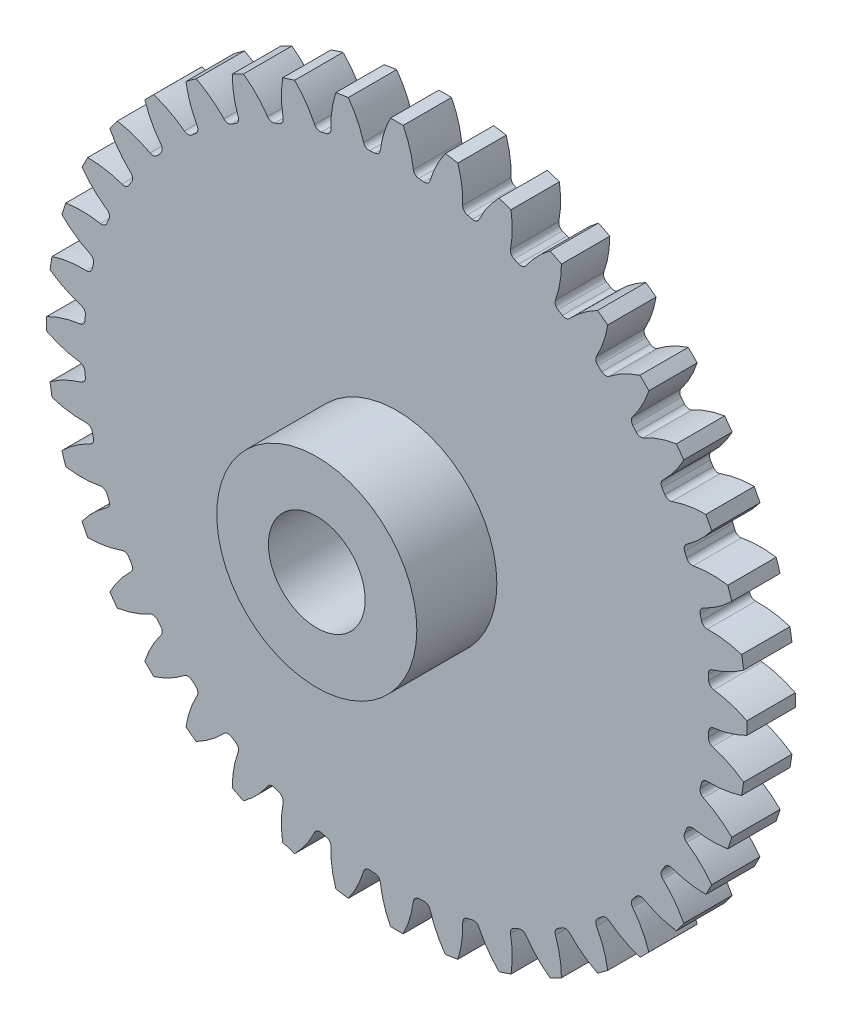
from build123d import *
from build123d.topology import SkipClean

# Parameters (mm, degrees)
BOSS_EXTRU_1_DEPTH                 = 1.45
CONG_1_R                           = 0.175
R_P_TITION_CIRCULAIRE4_COUNT       = 40
CONG_1_OF_R_P_TITION_CIRCULAIRE4_R = 0.175
ESQUISSE10_R                       = 1.45
ENL_V_MAT_EXTRU_4_DEPTH            = 17.295323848
ESQUISSE12_R                       = 3
ESQUISSE12_R_2                     = 1.45
EXTRUSION2_DEPTH                   = 2.4
EXTRUSION1_START                   = 0.5
ESQUISSE11_R                       = 2.2
ESQUISSE11_R_2                     = 1.45
EXTRUSION1_DEPTH                   = 0.5


with BuildPart() as part:
    # Esquisse3 → Boss.-Extru.1 (new body)
    with BuildSketch(Plane.XY):
        with BuildLine():
            Line((-2.114260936, 8.785747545), (-1.378706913, -0.560352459))
            Line((-1.378706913, -0.560352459), (-0.643152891, 8.785747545))
            ThreePointArc((-0.643152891, 8.785747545), (-0.755559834, 8.793914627), (-0.868056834, 8.800729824))
            ThreePointArc((-0.868056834, 8.800729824), (-0.972489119, 9.385057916), (-1.188551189, 9.937925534))
            ThreePointArc((-1.188551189, 9.937925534), (-1.378706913, 9.939647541), (-1.568862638, 9.937925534))
            ThreePointArc((-1.568862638, 9.937925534), (-1.784924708, 9.385057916), (-1.889356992, 8.800729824))
            ThreePointArc((-1.889356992, 8.800729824), (-2.001853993, 8.793914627), (-2.114260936, 8.785747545))
        make_face()
    boss_extru_1 = extrude(amount=BOSS_EXTRU_1_DEPTH)

    # Cong_1
    cong_1_edges = [part.edges().sort_by_distance(p)[0] for p in [
        (-1.889356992, 8.800729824, 0.725),
        (-0.868056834, 8.800729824, 0.725),
    ]]
    fillet(cong_1_edges, radius=CONG_1_R)

    # R_p_tition circulaire4: Boss.-Extru.1 ×40 about axis
    r_p_tition_circulaire4_axis = Axis((-1.378706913, -0.560352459, 0), (0, 0, 1))
    for i in range(1, R_P_TITION_CIRCULAIRE4_COUNT):
        add(boss_extru_1.rotate(r_p_tition_circulaire4_axis, i * 360 / R_P_TITION_CIRCULAIRE4_COUNT))

    # Cong_1 of R_p_tition circulaire4
    cong_1_of_r_p_tition_circulaire4_edges = [part.edges().sort_by_distance(p)[0] for p in [
        (-3.347465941, 8.605596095, 0.725),
        (-2.338739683, 8.765362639, 0.725),
        (-4.757097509, 8.184766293, 0.725),
        (-3.785783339, 8.500365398, 0.725),
        (-6.083541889, 7.548602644, 0.725),
        (-5.173556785, 8.012263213, 0.725),
        (-7.294137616, 6.712769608, 0.725),
        (-6.467888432, 7.313074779, 0.725),
        (-8.359075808, 5.697848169, 0.725),
        (-7.636907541, 6.420016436, 0.725),
        (-9.252134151, 4.52882906, 0.725),
        (-8.65182898, 5.355078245, 0.725),
        (-9.951322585, 3.234497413, 0.725),
        (-9.487662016, 4.144482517, 0.725),
        (-10.43942477, 1.846723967, 0.725),
        (-10.123825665, 2.818038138, 0.725),
        (-10.704422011, 0.399680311, 0.725),
        (-10.544655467, 1.40840657, 0.725),
        (-10.739789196, -1.071002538, 0.725),
        (-10.739789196, -0.04970238, 0.725),
        (-10.544655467, -2.529111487, 0.725),
        (-10.704422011, -1.520385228, 0.725),
        (-10.123825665, -3.938743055, 0.725),
        (-10.43942477, -2.967428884, 0.725),
        (-9.487662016, -5.265187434, 0.725),
        (-9.951322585, -4.35520233, 0.725),
        (-8.65182898, -6.475783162, 0.725),
        (-9.252134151, -5.649533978, 0.725),
        (-7.636907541, -7.540721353, 0.725),
        (-8.359075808, -6.818553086, 0.725),
        (-6.467888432, -8.433779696, 0.725),
        (-7.294137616, -7.833474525, 0.725),
        (-5.173556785, -9.13296813, 0.725),
        (-6.083541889, -8.669307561, 0.725),
        (-3.785783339, -9.621070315, 0.725),
        (-4.757097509, -9.30547121, 0.725),
        (-2.338739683, -9.886067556, 0.725),
        (-3.347465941, -9.726301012, 0.725),
        (-0.868056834, -9.921434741, 0.725),
        (-1.889356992, -9.921434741, 0.725),
        (0.590052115, -9.726301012, 0.725),
        (-0.418674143, -9.886067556, 0.725),
        (1.999683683, -9.30547121, 0.725),
        (1.028369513, -9.621070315, 0.725),
        (3.326128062, -8.669307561, 0.725),
        (2.416142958, -9.13296813, 0.725),
        (4.53672379, -7.833474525, 0.725),
        (3.710474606, -8.433779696, 0.725),
        (5.601661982, -6.818553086, 0.725),
        (4.879493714, -7.540721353, 0.725),
        (6.494720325, -5.649533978, 0.725),
        (5.894415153, -6.475783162, 0.725),
        (7.193908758, -4.35520233, 0.725),
        (6.730248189, -5.265187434, 0.725),
        (7.682010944, -2.967428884, 0.725),
        (7.366411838, -3.938743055, 0.725),
        (7.947008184, -1.520385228, 0.725),
        (7.787241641, -2.529111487, 0.725),
        (7.982375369, -0.04970238, 0.725),
        (7.982375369, -1.071002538, 0.725),
        (7.787241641, 1.40840657, 0.725),
        (7.947008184, 0.399680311, 0.725),
        (7.366411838, 2.818038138, 0.725),
        (7.682010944, 1.846723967, 0.725),
        (6.730248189, 4.144482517, 0.725),
        (7.193908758, 3.234497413, 0.725),
        (5.894415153, 5.355078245, 0.725),
        (6.494720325, 4.52882906, 0.725),
        (4.879493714, 6.420016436, 0.725),
        (5.601661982, 5.697848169, 0.725),
        (3.710474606, 7.313074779, 0.725),
        (4.53672379, 6.712769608, 0.725),
        (2.416142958, 8.012263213, 0.725),
        (3.326128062, 7.548602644, 0.725),
        (1.028369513, 8.500365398, 0.725),
        (1.999683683, 8.184766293, 0.725),
        (-0.418674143, 8.765362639, 0.725),
        (0.590052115, 8.605596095, 0.725),
    ]]
    fillet(cong_1_of_r_p_tition_circulaire4_edges, radius=CONG_1_OF_R_P_TITION_CIRCULAIRE4_R)

    # Esquisse10 → Enl_v. mat.-Extru.4 (cut, through all)
    with BuildSketch(Plane.XY):
        with Locations((-1.378706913, -0.560352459)):
            Circle(ESQUISSE10_R)
    extrude(amount=ENL_V_MAT_EXTRU_4_DEPTH, mode=Mode.SUBTRACT)

    # Esquisse12 → Extrusion2 (add)
    with BuildSketch(Plane.XY.offset(1.45)):
        with Locations((-1.378706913, -0.560352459)):
            Circle(ESQUISSE12_R)
        with Locations((-1.378706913, -0.560352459)):
            Circle(ESQUISSE12_R_2, mode=Mode.SUBTRACT)
    extrude(amount=EXTRUSION2_DEPTH)

    # Esquisse11 → Extrusion1 (add)
    with SkipClean():  # the faces are left unmerged after this step: merging them gives an invalid solid
        with BuildSketch(Plane(origin=(0, 0, 0), x_dir=(-1, 0, 0), z_dir=(0, 0, -1)).offset(EXTRUSION1_START)):
            with Locations(Location((1.378706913, -0.560352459, 0), (0, 0, 180))):
                Circle(ESQUISSE11_R)
            with Locations((1.378706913, -0.560352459)):
                Circle(ESQUISSE11_R_2, mode=Mode.SUBTRACT)
        extrude(amount=-EXTRUSION1_DEPTH)


solid = part.part
